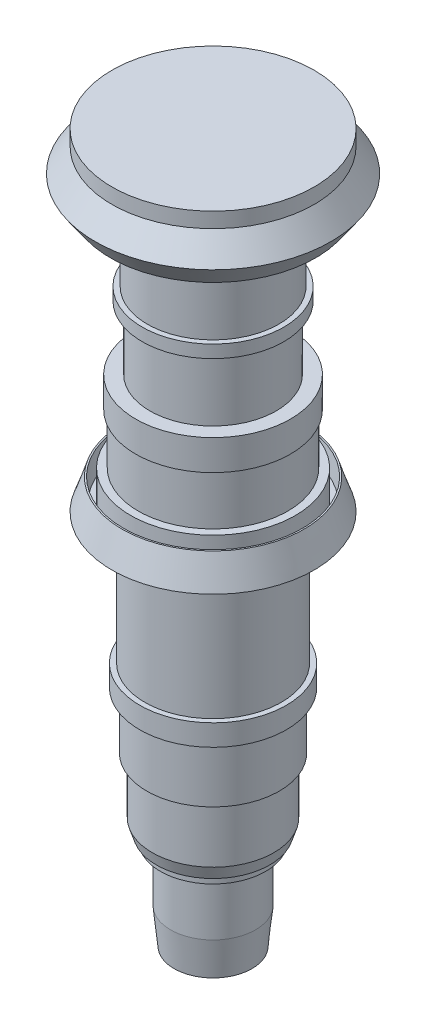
from build123d import *

# Parameters (mm, degrees)
SKETCH_2_R          = 70
CUT_EXTRUDE_1_DEPTH = 420


with BuildPart() as part:
    # Sketch 1 → Revolve 1 (revolve)
    with BuildSketch(Plane.XY, mode=Mode.PRIVATE) as revolve_1_sk:
        Polygon((0, 0), (0, 1400), (200, 1400), (200, 1370), (233, 1322.871115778), (202.981321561, 1280), (188, 1280), (188, 1340), (146, 1340), (146, 1280), (130, 1280), (130, 1130), (140, 1130), (140, 1105), (125, 1105), (125, 979), (153, 979), (153, 919), (148, 919), (148, 819), (163, 819), (163, 759), (175, 759), (177, 804), (180, 804), (200, 744), (197, 744), (191, 755), (135, 755), (135, 485), (145, 485), (145, 443), (131, 443), (131, 331), (120, 331), (120, 220), (112, 195), (104, 195), (104, 180), (84, 180), (84, 70), (77, 0), align=None)
    revolve(revolve_1_sk.sketch.rotate(Axis((0, 0, 0), (0, 1, 0)), 90), axis=Axis((0, 0, 0), (0, 1, 0)))

    # Sketch 2 → Cut-Extrude 1 (cut)
    with BuildSketch(Plane.XZ):
        with Locations(Location((0, 0, 0), (0, 0, 270))):
            Circle(SKETCH_2_R)
    extrude(amount=-CUT_EXTRUDE_1_DEPTH, mode=Mode.SUBTRACT)


solid = part.part
